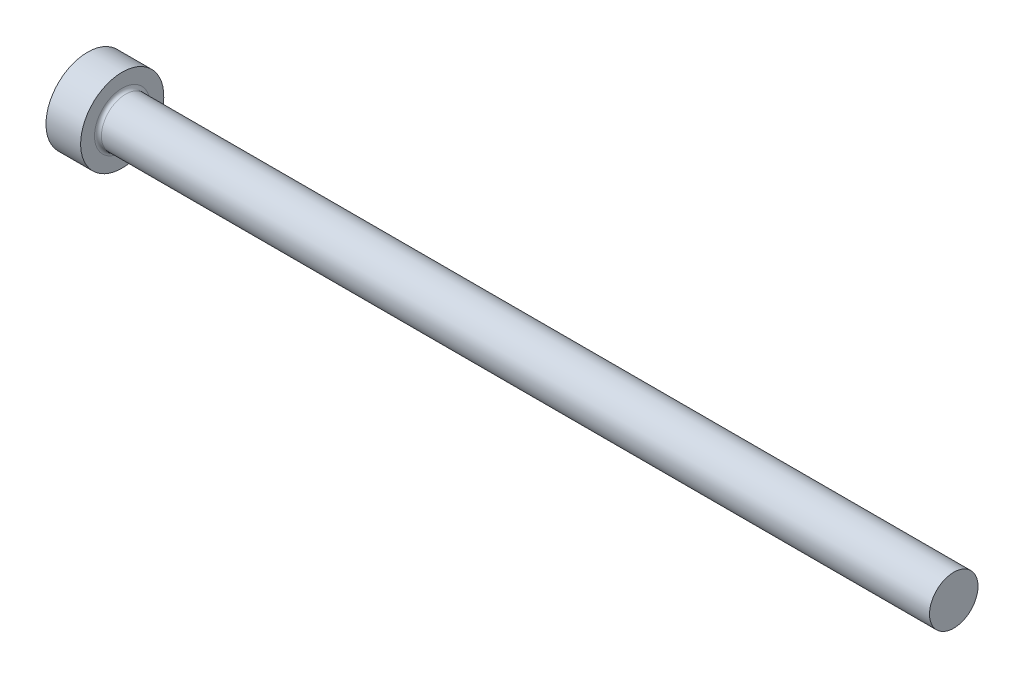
ISO-10303-21;
HEADER;
FILE_DESCRIPTION(('STEP AP214'),'2;1');
FILE_NAME('part.step','',(''),(''),'','','');
FILE_SCHEMA(('AUTOMOTIVE_DESIGN { 1 0 10303 214 1 1 1 1 }'));
ENDSEC;
DATA;
#1=APPLICATION_CONTEXT('core data for automotive mechanical design processes');
#2=APPLICATION_PROTOCOL_DEFINITION('international standard','automotive_design',2000,#1);
#3=PRODUCT_CONTEXT('',#1,'mechanical');
#4=PRODUCT('Part','Part','',(#3));
#5=PRODUCT_RELATED_PRODUCT_CATEGORY('part','',(#4));
#6=PRODUCT_DEFINITION_FORMATION('','',#4);
#7=PRODUCT_DEFINITION_CONTEXT('part definition',#1,'design');
#8=PRODUCT_DEFINITION('design','',#6,#7);
#9=PRODUCT_DEFINITION_SHAPE('','',#8);
#10=(LENGTH_UNIT() NAMED_UNIT(*) SI_UNIT(.MILLI.,.METRE.));
#11=(NAMED_UNIT(*) PLANE_ANGLE_UNIT() SI_UNIT($,.RADIAN.));
#12=(NAMED_UNIT(*) SI_UNIT($,.STERADIAN.) SOLID_ANGLE_UNIT());
#13=UNCERTAINTY_MEASURE_WITH_UNIT(LENGTH_MEASURE(1.E-05),#10,'distance_accuracy_value','');
#14=(GEOMETRIC_REPRESENTATION_CONTEXT(3) GLOBAL_UNCERTAINTY_ASSIGNED_CONTEXT((#13)) GLOBAL_UNIT_ASSIGNED_CONTEXT((#10,
#11,#12)) REPRESENTATION_CONTEXT('',''));
#15=CARTESIAN_POINT('',(0.,0.,0.));
#16=DIRECTION('',(0.,0.,1.));
#17=DIRECTION('',(1.,0.,0.));
#18=AXIS2_PLACEMENT_3D('',#15,#16,#17);
#19=CARTESIAN_POINT('',(0.,0.,0.));
#20=DIRECTION('',(-1.,0.,0.));
#21=DIRECTION('',(0.,-1.,0.));
#22=AXIS2_PLACEMENT_3D('',#19,#20,#21);
#23=PLANE('',#22);
#24=CARTESIAN_POINT('',(0.,0.,0.));
#25=DIRECTION('',(1.,0.,0.));
#26=DIRECTION('',(0.,1.,0.));
#27=AXIS2_PLACEMENT_3D('',#24,#25,#26);
#28=CIRCLE('',#27,6.);
#29=CARTESIAN_POINT('',(0.,6.,0.));
#30=VERTEX_POINT('',#29);
#31=EDGE_CURVE('E25',#30,#30,#28,.T.);
#32=ORIENTED_EDGE('',*,*,#31,.F.);
#33=EDGE_LOOP('',(#32));
#34=FACE_BOUND('',#33,.T.);
#35=ADVANCED_FACE('F14',(#34),#23,.T.);
#36=CARTESIAN_POINT('',(125.,0.,0.));
#37=DIRECTION('',(1.,0.,0.));
#38=DIRECTION('',(0.,1.,0.));
#39=AXIS2_PLACEMENT_3D('',#36,#37,#38);
#40=CYLINDRICAL_SURFACE('',#39,6.);
#41=ORIENTED_EDGE('',*,*,#31,.T.);
#42=EDGE_LOOP('',(#41));
#43=FACE_BOUND('',#42,.T.);
#44=CARTESIAN_POINT('',(5.,0.,0.));
#45=DIRECTION('',(1.,0.,0.));
#46=DIRECTION('',(0.,1.,0.));
#47=AXIS2_PLACEMENT_3D('',#44,#45,#46);
#48=CIRCLE('',#47,6.);
#49=CARTESIAN_POINT('',(5.,6.,0.));
#50=VERTEX_POINT('',#49);
#51=EDGE_CURVE('E29',#50,#50,#48,.T.);
#52=ORIENTED_EDGE('',*,*,#51,.F.);
#53=EDGE_LOOP('',(#52));
#54=FACE_BOUND('',#53,.T.);
#55=ADVANCED_FACE('F51',(#43,#54),#40,.T.);
#56=CARTESIAN_POINT('',(5.,6.,0.));
#57=DIRECTION('',(1.,0.,0.));
#58=DIRECTION('',(0.,1.,0.));
#59=AXIS2_PLACEMENT_3D('',#56,#57,#58);
#60=PLANE('',#59);
#61=CARTESIAN_POINT('',(5.,0.,0.));
#62=DIRECTION('',(1.,0.,0.));
#63=DIRECTION('',(0.,1.,0.));
#64=AXIS2_PLACEMENT_3D('',#61,#62,#63);
#65=CIRCLE('',#64,4.);
#66=CARTESIAN_POINT('',(5.,4.,0.));
#67=VERTEX_POINT('',#66);
#68=EDGE_CURVE('E9',#67,#67,#65,.F.);
#69=ORIENTED_EDGE('',*,*,#68,.T.);
#70=EDGE_LOOP('',(#69));
#71=FACE_BOUND('',#70,.T.);
#72=ORIENTED_EDGE('',*,*,#51,.T.);
#73=EDGE_LOOP('',(#72));
#74=FACE_BOUND('',#73,.T.);
#75=ADVANCED_FACE('F42',(#71,#74),#60,.T.);
#76=CARTESIAN_POINT('',(125.,0.,0.));
#77=DIRECTION('',(1.,0.,0.));
#78=DIRECTION('',(0.,1.,0.));
#79=AXIS2_PLACEMENT_3D('',#76,#77,#78);
#80=CYLINDRICAL_SURFACE('',#79,3.5);
#81=CARTESIAN_POINT('',(5.5,0.,0.));
#82=DIRECTION('',(1.,0.,0.));
#83=DIRECTION('',(0.,1.,0.));
#84=AXIS2_PLACEMENT_3D('',#81,#82,#83);
#85=CIRCLE('',#84,3.5);
#86=CARTESIAN_POINT('',(5.5,3.5,0.));
#87=VERTEX_POINT('',#86);
#88=EDGE_CURVE('E21',#87,#87,#85,.T.);
#89=ORIENTED_EDGE('',*,*,#88,.T.);
#90=EDGE_LOOP('',(#89));
#91=FACE_BOUND('',#90,.T.);
#92=CARTESIAN_POINT('',(125.,0.,0.));
#93=DIRECTION('',(1.,0.,0.));
#94=DIRECTION('',(0.,1.,0.));
#95=AXIS2_PLACEMENT_3D('',#92,#93,#94);
#96=CIRCLE('',#95,3.5);
#97=CARTESIAN_POINT('',(125.,3.5,0.));
#98=VERTEX_POINT('',#97);
#99=EDGE_CURVE('E34',#98,#98,#96,.T.);
#100=ORIENTED_EDGE('',*,*,#99,.F.);
#101=EDGE_LOOP('',(#100));
#102=FACE_BOUND('',#101,.T.);
#103=ADVANCED_FACE('F40',(#91,#102),#80,.T.);
#104=CARTESIAN_POINT('',(125.,3.5,0.));
#105=DIRECTION('',(1.,0.,0.));
#106=DIRECTION('',(0.,1.,0.));
#107=AXIS2_PLACEMENT_3D('',#104,#105,#106);
#108=PLANE('',#107);
#109=ORIENTED_EDGE('',*,*,#99,.T.);
#110=EDGE_LOOP('',(#109));
#111=FACE_BOUND('',#110,.T.);
#112=ADVANCED_FACE('F38',(#111),#108,.T.);
#113=CARTESIAN_POINT('',(5.5,0.,0.));
#114=DIRECTION('',(1.,0.,0.));
#115=DIRECTION('',(0.,1.,0.));
#116=AXIS2_PLACEMENT_3D('',#113,#114,#115);
#117=TOROIDAL_SURFACE('',#116,4.,0.5);
#118=ORIENTED_EDGE('',*,*,#68,.F.);
#119=EDGE_LOOP('',(#118));
#120=FACE_BOUND('',#119,.T.);
#121=ORIENTED_EDGE('',*,*,#88,.F.);
#122=EDGE_LOOP('',(#121));
#123=FACE_BOUND('',#122,.T.);
#124=ADVANCED_FACE('F16',(#120,#123),#117,.F.);
#125=CLOSED_SHELL('',(#35,#55,#75,#103,#112,#124));
#126=MANIFOLD_SOLID_BREP('B1',#125);
#127=ADVANCED_BREP_SHAPE_REPRESENTATION('',(#18,#126),#14);
#128=SHAPE_DEFINITION_REPRESENTATION(#9,#127);
ENDSEC;
END-ISO-10303-21;
